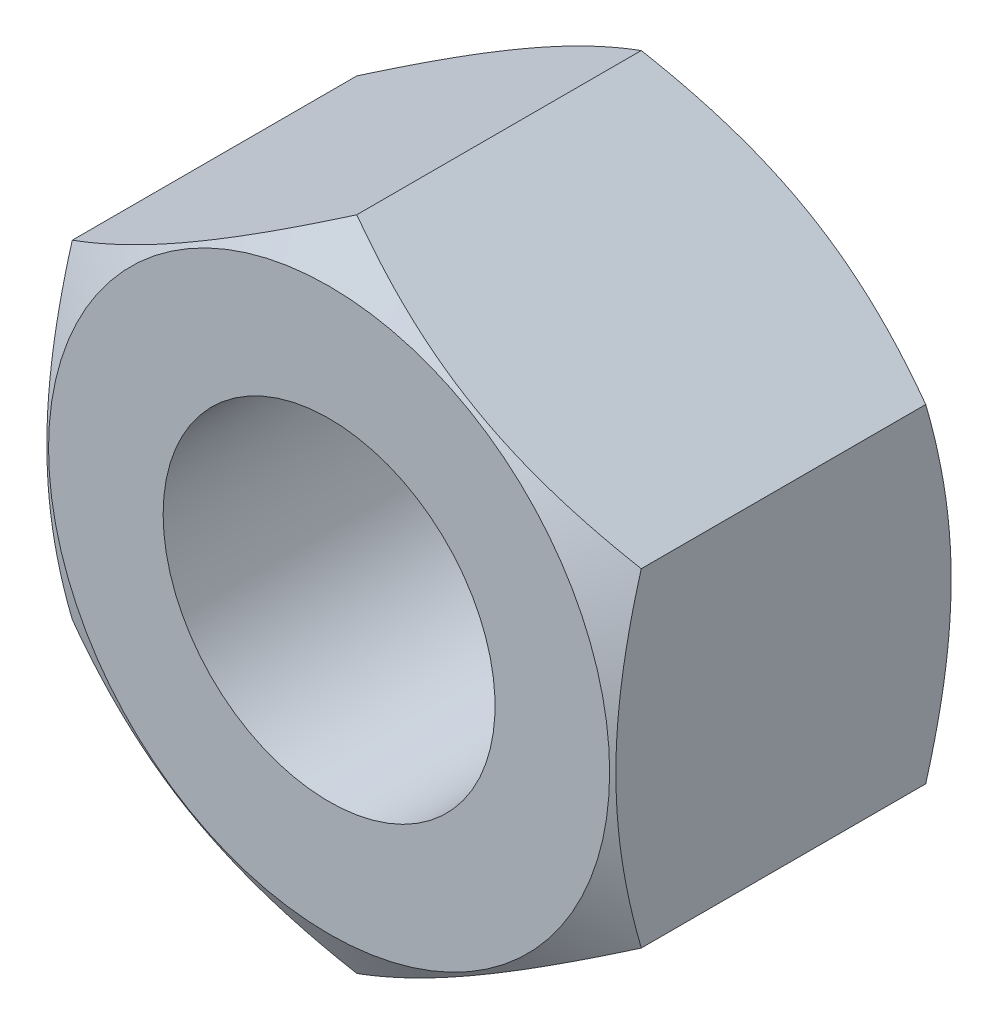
from build123d import *

# Parameters (mm, degrees)
BASE_EXTRUSION_DEPTH = 21.5
TROU_TARAUD_M241_D   = 21


with BuildPart() as part:
    # Esquisse1 → Base-Extrusion (new body)
    with BuildSketch(Plane.XY):
        Polygon((18, 10.392304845), (0, 20.784609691), (-18, 10.392304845), (-18, -10.392304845), (0, -20.784609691), (18, -10.392304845), align=None)
    extrude(amount=BASE_EXTRUSION_DEPTH)

    # Esquisse4 → Enl_vement de mati_re-R_volution1 (revolve, cut)
    with BuildSketch(Plane(origin=(0, 0, 0), x_dir=(0, 0, -1), z_dir=(1, 0, 0)), mode=Mode.PRIVATE) as enl_vement_de_mati_re_r_volution1_sk:
        Polygon((-1.752032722, 20.784609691), (0, 20.784609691), (0, 17.75), align=None)
        Polygon((-21.5, 20.784609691), (-19.747967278, 20.784609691), (-21.5, 17.75), align=None)
    revolve(enl_vement_de_mati_re_r_volution1_sk.sketch.rotate(Axis((0, 0, -2.764517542), (0, 0, 1)), 300.000000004), axis=Axis((0, 0, -2.764517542), (0, 0, 1)), mode=Mode.SUBTRACT)

    # Trou taraud_ M241 (through all)
    with Locations(Plane(origin=(0, 0, 0), x_dir=(-1, 0, 0), z_dir=(0, 0, -1))):
        with Locations((0, 0)):
            Hole(TROU_TARAUD_M241_D / 2)


solid = part.part
